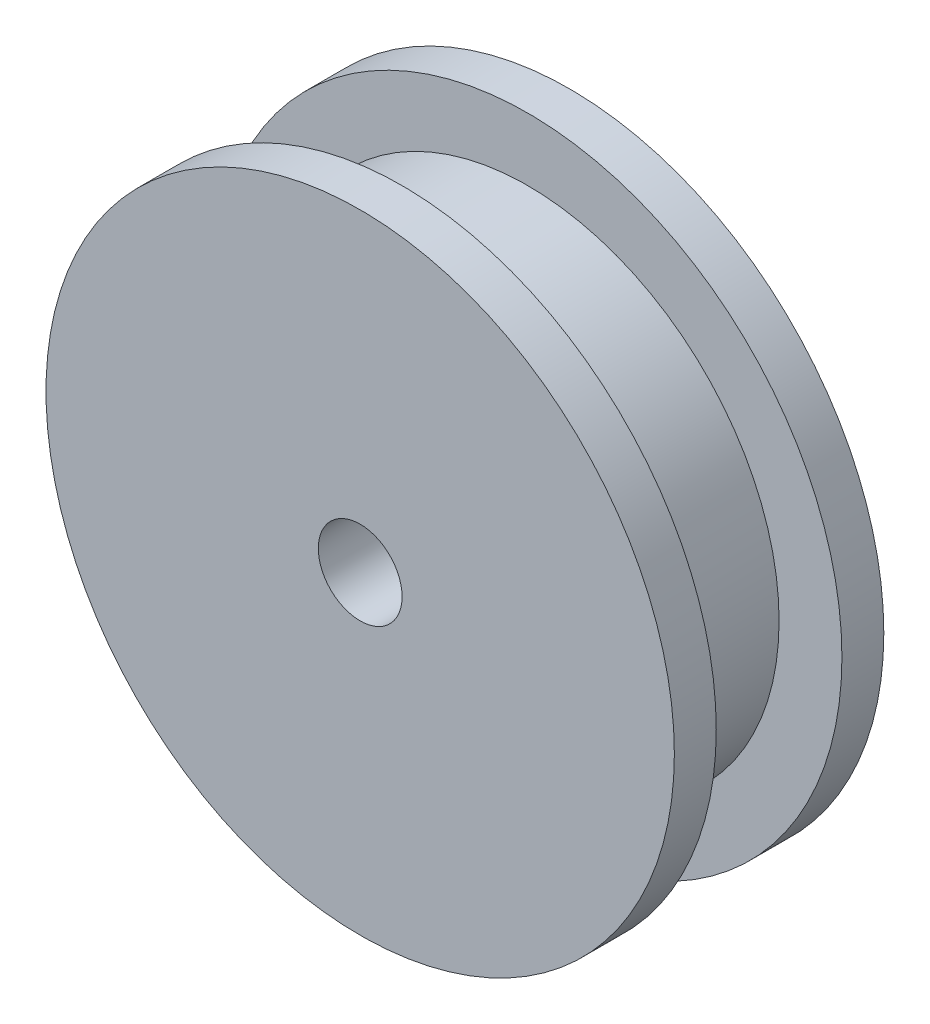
from build123d import *


with BuildPart() as part:
    # Sketch1 → Revolve2 (revolve)
    with BuildSketch(Plane(origin=(0, 0, 0), x_dir=(0, 0, -1), z_dir=(1, 0, 0)), mode=Mode.PRIVATE) as revolve2_sk:
        Polygon((19.05, 76.2), (19.05, 95.25), (31.75, 95.25), (31.75, 12.7), (-31.75, 12.7), (-31.75, 95.25), (-19.05, 95.25), (-19.05, 76.2), align=None)
    revolve(revolve2_sk.sketch.rotate(Axis((0, 0, 51.105946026), (0, 0, -1)), 90), axis=Axis((0, 0, 51.105946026), (0, 0, -1)))


solid = part.part
